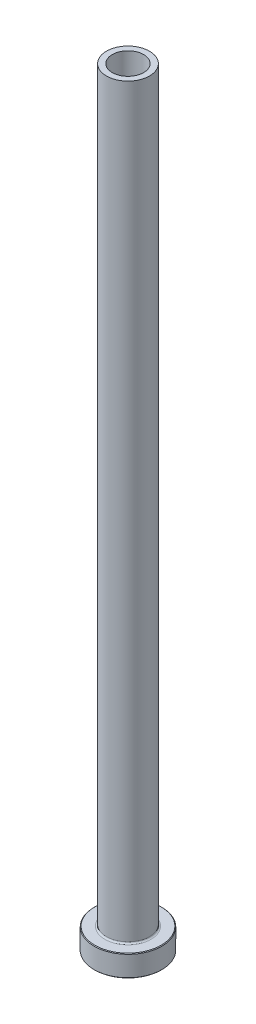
ISO-10303-21;
HEADER;
FILE_DESCRIPTION(('STEP AP214'),'2;1');
FILE_NAME('part.step','',(''),(''),'','','');
FILE_SCHEMA(('AUTOMOTIVE_DESIGN { 1 0 10303 214 1 1 1 1 }'));
ENDSEC;
DATA;
#1=APPLICATION_CONTEXT('core data for automotive mechanical design processes');
#2=APPLICATION_PROTOCOL_DEFINITION('international standard','automotive_design',2000,#1);
#3=PRODUCT_CONTEXT('',#1,'mechanical');
#4=PRODUCT('Part','Part','',(#3));
#5=PRODUCT_RELATED_PRODUCT_CATEGORY('part','',(#4));
#6=PRODUCT_DEFINITION_FORMATION('','',#4);
#7=PRODUCT_DEFINITION_CONTEXT('part definition',#1,'design');
#8=PRODUCT_DEFINITION('design','',#6,#7);
#9=PRODUCT_DEFINITION_SHAPE('','',#8);
#10=(LENGTH_UNIT() NAMED_UNIT(*) SI_UNIT(.MILLI.,.METRE.));
#11=(NAMED_UNIT(*) PLANE_ANGLE_UNIT() SI_UNIT($,.RADIAN.));
#12=(NAMED_UNIT(*) SI_UNIT($,.STERADIAN.) SOLID_ANGLE_UNIT());
#13=UNCERTAINTY_MEASURE_WITH_UNIT(LENGTH_MEASURE(1.E-05),#10,'distance_accuracy_value','');
#14=(GEOMETRIC_REPRESENTATION_CONTEXT(3) GLOBAL_UNCERTAINTY_ASSIGNED_CONTEXT((#13)) GLOBAL_UNIT_ASSIGNED_CONTEXT((#10,
#11,#12)) REPRESENTATION_CONTEXT('',''));
#15=CARTESIAN_POINT('',(0.,0.,0.));
#16=DIRECTION('',(0.,0.,1.));
#17=DIRECTION('',(1.,0.,0.));
#18=AXIS2_PLACEMENT_3D('',#15,#16,#17);
#19=CARTESIAN_POINT('',(0.,92.1876809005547,0.));
#20=DIRECTION('',(0.,1.,0.));
#21=DIRECTION('',(0.,0.,1.));
#22=AXIS2_PLACEMENT_3D('',#19,#20,#21);
#23=CYLINDRICAL_SURFACE('',#22,5.10000000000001);
#24=CARTESIAN_POINT('',(0.,250.,0.));
#25=DIRECTION('',(0.,1.,0.));
#26=DIRECTION('',(0.,0.,1.));
#27=AXIS2_PLACEMENT_3D('',#24,#25,#26);
#28=CIRCLE('',#27,5.10000000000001);
#29=CARTESIAN_POINT('',(0.,250.,5.10000000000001));
#30=VERTEX_POINT('',#29);
#31=EDGE_CURVE('E62',#30,#30,#28,.T.);
#32=ORIENTED_EDGE('',*,*,#31,.T.);
#33=EDGE_LOOP('',(#32));
#34=FACE_BOUND('',#33,.T.);
#35=CARTESIAN_POINT('',(0.,195.,0.));
#36=DIRECTION('',(0.,1.,0.));
#37=DIRECTION('',(0.,0.,1.));
#38=AXIS2_PLACEMENT_3D('',#35,#36,#37);
#39=CIRCLE('',#38,5.10000000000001);
#40=CARTESIAN_POINT('',(0.,195.,5.10000000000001));
#41=VERTEX_POINT('',#40);
#42=EDGE_CURVE('E71',#41,#41,#39,.T.);
#43=ORIENTED_EDGE('',*,*,#42,.F.);
#44=EDGE_LOOP('',(#43));
#45=FACE_BOUND('',#44,.T.);
#46=ADVANCED_FACE('F30',(#34,#45),#23,.F.);
#47=CARTESIAN_POINT('',(-5.10000000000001,250.,0.));
#48=DIRECTION('',(0.,1.,0.));
#49=DIRECTION('',(0.,0.,1.));
#50=AXIS2_PLACEMENT_3D('',#47,#48,#49);
#51=PLANE('',#50);
#52=CARTESIAN_POINT('',(0.,250.,0.));
#53=DIRECTION('',(0.,1.,0.));
#54=DIRECTION('',(0.,0.,1.));
#55=AXIS2_PLACEMENT_3D('',#52,#53,#54);
#56=CIRCLE('',#55,7.00000000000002);
#57=CARTESIAN_POINT('',(0.,250.,7.00000000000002));
#58=VERTEX_POINT('',#57);
#59=EDGE_CURVE('E65',#58,#58,#56,.T.);
#60=ORIENTED_EDGE('',*,*,#59,.T.);
#61=EDGE_LOOP('',(#60));
#62=FACE_BOUND('',#61,.T.);
#63=ORIENTED_EDGE('',*,*,#31,.F.);
#64=EDGE_LOOP('',(#63));
#65=FACE_BOUND('',#64,.T.);
#66=ADVANCED_FACE('F79',(#62,#65),#51,.T.);
#67=CARTESIAN_POINT('',(0.,92.1876809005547,0.));
#68=DIRECTION('',(0.,1.,0.));
#69=DIRECTION('',(0.,0.,1.));
#70=AXIS2_PLACEMENT_3D('',#67,#68,#69);
#71=CYLINDRICAL_SURFACE('',#70,7.);
#72=CARTESIAN_POINT('',(0.,7.50000000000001,0.));
#73=DIRECTION('',(0.,1.,0.));
#74=DIRECTION('',(0.,0.,1.));
#75=AXIS2_PLACEMENT_3D('',#72,#73,#74);
#76=CIRCLE('',#75,7.);
#77=CARTESIAN_POINT('',(0.,7.50000000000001,7.));
#78=VERTEX_POINT('',#77);
#79=EDGE_CURVE('E59',#78,#78,#76,.T.);
#80=ORIENTED_EDGE('',*,*,#79,.T.);
#81=EDGE_LOOP('',(#80));
#82=FACE_BOUND('',#81,.T.);
#83=ORIENTED_EDGE('',*,*,#59,.F.);
#84=EDGE_LOOP('',(#83));
#85=FACE_BOUND('',#84,.T.);
#86=ADVANCED_FACE('F85',(#82,#85),#71,.T.);
#87=CARTESIAN_POINT('',(-6.99999999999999,7.,0.));
#88=DIRECTION('',(0.,1.,0.));
#89=DIRECTION('',(0.,0.,1.));
#90=AXIS2_PLACEMENT_3D('',#87,#88,#89);
#91=PLANE('',#90);
#92=CARTESIAN_POINT('',(0.,7.,0.));
#93=DIRECTION('',(0.,1.,0.));
#94=DIRECTION('',(0.,0.,1.));
#95=AXIS2_PLACEMENT_3D('',#92,#93,#94);
#96=CIRCLE('',#95,10.8);
#97=CARTESIAN_POINT('',(0.,7.,10.8));
#98=VERTEX_POINT('',#97);
#99=EDGE_CURVE('E53',#98,#98,#96,.T.);
#100=ORIENTED_EDGE('',*,*,#99,.T.);
#101=EDGE_LOOP('',(#100));
#102=FACE_BOUND('',#101,.T.);
#103=CARTESIAN_POINT('',(0.,7.,0.));
#104=DIRECTION('',(0.,1.,0.));
#105=DIRECTION('',(0.,0.,1.));
#106=AXIS2_PLACEMENT_3D('',#103,#104,#105);
#107=CIRCLE('',#106,7.50000000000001);
#108=CARTESIAN_POINT('',(0.,7.,7.50000000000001));
#109=VERTEX_POINT('',#108);
#110=EDGE_CURVE('E56',#109,#109,#107,.F.);
#111=ORIENTED_EDGE('',*,*,#110,.T.);
#112=EDGE_LOOP('',(#111));
#113=FACE_BOUND('',#112,.T.);
#114=ADVANCED_FACE('F111',(#102,#113),#91,.T.);
#115=CARTESIAN_POINT('',(0.,92.1876809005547,0.));
#116=DIRECTION('',(0.,1.,0.));
#117=DIRECTION('',(0.,0.,1.));
#118=AXIS2_PLACEMENT_3D('',#115,#116,#117);
#119=CYLINDRICAL_SURFACE('',#118,11.);
#120=CARTESIAN_POINT('',(0.,6.79999999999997,0.));
#121=DIRECTION('',(0.,1.,0.));
#122=DIRECTION('',(0.,0.,1.));
#123=AXIS2_PLACEMENT_3D('',#120,#121,#122);
#124=CIRCLE('',#123,11.);
#125=CARTESIAN_POINT('',(0.,6.79999999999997,11.));
#126=VERTEX_POINT('',#125);
#127=EDGE_CURVE('E45',#126,#126,#124,.F.);
#128=ORIENTED_EDGE('',*,*,#127,.T.);
#129=EDGE_LOOP('',(#128));
#130=FACE_BOUND('',#129,.T.);
#131=CARTESIAN_POINT('',(0.,0.200000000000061,0.));
#132=DIRECTION('',(0.,-1.,0.));
#133=DIRECTION('',(0.,0.,-1.));
#134=AXIS2_PLACEMENT_3D('',#131,#132,#133);
#135=CIRCLE('',#134,11.);
#136=CARTESIAN_POINT('',(0.,0.200000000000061,-11.));
#137=VERTEX_POINT('',#136);
#138=EDGE_CURVE('E50',#137,#137,#135,.F.);
#139=ORIENTED_EDGE('',*,*,#138,.T.);
#140=EDGE_LOOP('',(#139));
#141=FACE_BOUND('',#140,.T.);
#142=ADVANCED_FACE('F108',(#130,#141),#119,.T.);
#143=CARTESIAN_POINT('',(-11.,0.,0.));
#144=DIRECTION('',(0.,-1.,0.));
#145=DIRECTION('',(0.,0.,-1.));
#146=AXIS2_PLACEMENT_3D('',#143,#144,#145);
#147=PLANE('',#146);
#148=CARTESIAN_POINT('',(0.,0.,0.));
#149=DIRECTION('',(0.,-1.,0.));
#150=DIRECTION('',(0.,0.,-1.));
#151=AXIS2_PLACEMENT_3D('',#148,#149,#150);
#152=CIRCLE('',#151,5.85000000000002);
#153=CARTESIAN_POINT('',(0.,0.,-5.85000000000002));
#154=VERTEX_POINT('',#153);
#155=EDGE_CURVE('E37',#154,#154,#152,.F.);
#156=ORIENTED_EDGE('',*,*,#155,.T.);
#157=EDGE_LOOP('',(#156));
#158=FACE_BOUND('',#157,.T.);
#159=CARTESIAN_POINT('',(0.,0.,0.));
#160=DIRECTION('',(0.,-1.,0.));
#161=DIRECTION('',(0.,0.,-1.));
#162=AXIS2_PLACEMENT_3D('',#159,#160,#161);
#163=CIRCLE('',#162,10.7999999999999);
#164=CARTESIAN_POINT('',(0.,0.,-10.7999999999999));
#165=VERTEX_POINT('',#164);
#166=EDGE_CURVE('E41',#165,#165,#163,.T.);
#167=ORIENTED_EDGE('',*,*,#166,.T.);
#168=EDGE_LOOP('',(#167));
#169=FACE_BOUND('',#168,.T.);
#170=ADVANCED_FACE('F110',(#158,#169),#147,.T.);
#171=CARTESIAN_POINT('',(0.,92.1876809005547,0.));
#172=DIRECTION('',(0.,1.,0.));
#173=DIRECTION('',(0.,0.,1.));
#174=AXIS2_PLACEMENT_3D('',#171,#172,#173);
#175=CYLINDRICAL_SURFACE('',#174,5.35);
#176=CARTESIAN_POINT('',(0.,0.500000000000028,0.));
#177=DIRECTION('',(0.,-1.,0.));
#178=DIRECTION('',(0.,0.,-1.));
#179=AXIS2_PLACEMENT_3D('',#176,#177,#178);
#180=CIRCLE('',#179,5.35);
#181=CARTESIAN_POINT('',(0.,0.500000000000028,-5.35));
#182=VERTEX_POINT('',#181);
#183=EDGE_CURVE('E10',#182,#182,#180,.T.);
#184=ORIENTED_EDGE('',*,*,#183,.T.);
#185=EDGE_LOOP('',(#184));
#186=FACE_BOUND('',#185,.T.);
#187=CARTESIAN_POINT('',(0.,183.,0.));
#188=DIRECTION('',(0.,1.,0.));
#189=DIRECTION('',(0.,0.,1.));
#190=AXIS2_PLACEMENT_3D('',#187,#188,#189);
#191=CIRCLE('',#190,5.35000000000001);
#192=CARTESIAN_POINT('',(0.,183.,5.35000000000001));
#193=VERTEX_POINT('',#192);
#194=EDGE_CURVE('E68',#193,#193,#191,.T.);
#195=ORIENTED_EDGE('',*,*,#194,.T.);
#196=EDGE_LOOP('',(#195));
#197=FACE_BOUND('',#196,.T.);
#198=ADVANCED_FACE('F118',(#186,#197),#175,.F.);
#199=CARTESIAN_POINT('',(0.,183.,0.));
#200=DIRECTION('',(0.,-1.,0.));
#201=DIRECTION('',(0.,0.,-1.));
#202=AXIS2_PLACEMENT_3D('',#199,#200,#201);
#203=CONICAL_SURFACE('',#202,5.35000000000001,0.0208303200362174);
#204=ORIENTED_EDGE('',*,*,#42,.T.);
#205=EDGE_LOOP('',(#204));
#206=FACE_BOUND('',#205,.T.);
#207=ORIENTED_EDGE('',*,*,#194,.F.);
#208=EDGE_LOOP('',(#207));
#209=FACE_BOUND('',#208,.T.);
#210=ADVANCED_FACE('F75',(#206,#209),#203,.F.);
#211=CARTESIAN_POINT('',(0.,7.50000000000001,0.));
#212=DIRECTION('',(0.,1.,0.));
#213=DIRECTION('',(0.,0.,1.));
#214=AXIS2_PLACEMENT_3D('',#211,#212,#213);
#215=TOROIDAL_SURFACE('',#214,7.50000000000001,0.5);
#216=ORIENTED_EDGE('',*,*,#110,.F.);
#217=EDGE_LOOP('',(#216));
#218=FACE_BOUND('',#217,.T.);
#219=ORIENTED_EDGE('',*,*,#79,.F.);
#220=EDGE_LOOP('',(#219));
#221=FACE_BOUND('',#220,.T.);
#222=ADVANCED_FACE('F90',(#218,#221),#215,.F.);
#223=CARTESIAN_POINT('',(0.,7.00000000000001,0.));
#224=DIRECTION('',(0.,-1.,0.));
#225=DIRECTION('',(0.,0.,-1.));
#226=AXIS2_PLACEMENT_3D('',#223,#224,#225);
#227=CONICAL_SURFACE('',#226,10.7999999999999,0.785398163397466);
#228=ORIENTED_EDGE('',*,*,#127,.F.);
#229=EDGE_LOOP('',(#228));
#230=FACE_BOUND('',#229,.T.);
#231=ORIENTED_EDGE('',*,*,#99,.F.);
#232=EDGE_LOOP('',(#231));
#233=FACE_BOUND('',#232,.T.);
#234=ADVANCED_FACE('F93',(#230,#233),#227,.T.);
#235=CARTESIAN_POINT('',(0.,0.200000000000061,0.));
#236=DIRECTION('',(0.,1.,0.));
#237=DIRECTION('',(0.,0.,1.));
#238=AXIS2_PLACEMENT_3D('',#235,#236,#237);
#239=CONICAL_SURFACE('',#238,11.,0.785398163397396);
#240=ORIENTED_EDGE('',*,*,#166,.F.);
#241=EDGE_LOOP('',(#240));
#242=FACE_BOUND('',#241,.T.);
#243=ORIENTED_EDGE('',*,*,#138,.F.);
#244=EDGE_LOOP('',(#243));
#245=FACE_BOUND('',#244,.T.);
#246=ADVANCED_FACE('F96',(#242,#245),#239,.T.);
#247=CARTESIAN_POINT('',(0.,0.,0.));
#248=DIRECTION('',(0.,-1.,0.));
#249=DIRECTION('',(0.,0.,-1.));
#250=AXIS2_PLACEMENT_3D('',#247,#248,#249);
#251=CONICAL_SURFACE('',#250,5.85000000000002,0.785398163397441);
#252=ORIENTED_EDGE('',*,*,#183,.F.);
#253=EDGE_LOOP('',(#252));
#254=FACE_BOUND('',#253,.T.);
#255=ORIENTED_EDGE('',*,*,#155,.F.);
#256=EDGE_LOOP('',(#255));
#257=FACE_BOUND('',#256,.T.);
#258=ADVANCED_FACE('F32',(#254,#257),#251,.F.);
#259=CLOSED_SHELL('',(#46,#66,#86,#114,#142,#170,#198,#210,#222,#234,#246,#258));
#260=MANIFOLD_SOLID_BREP('B2',#259);
#261=ADVANCED_BREP_SHAPE_REPRESENTATION('',(#18,#260),#14);
#262=SHAPE_DEFINITION_REPRESENTATION(#9,#261);
ENDSEC;
END-ISO-10303-21;
